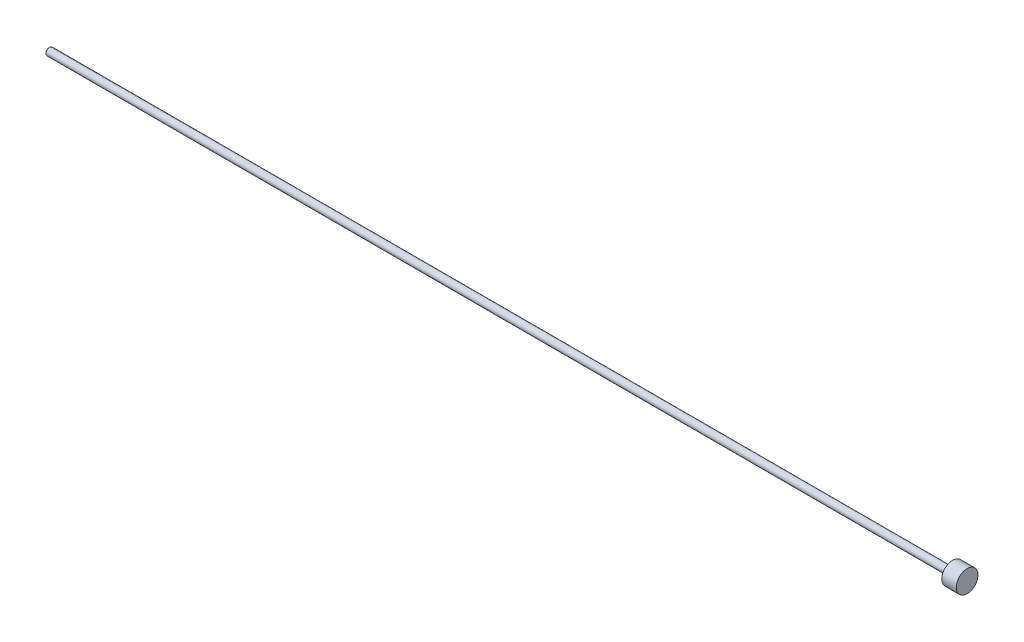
ISO-10303-21;
HEADER;
FILE_DESCRIPTION(('STEP AP214'),'2;1');
FILE_NAME('part.step','',(''),(''),'','','');
FILE_SCHEMA(('AUTOMOTIVE_DESIGN { 1 0 10303 214 1 1 1 1 }'));
ENDSEC;
DATA;
#1=APPLICATION_CONTEXT('core data for automotive mechanical design processes');
#2=APPLICATION_PROTOCOL_DEFINITION('international standard','automotive_design',2000,#1);
#3=PRODUCT_CONTEXT('',#1,'mechanical');
#4=PRODUCT('Part','Part','',(#3));
#5=PRODUCT_RELATED_PRODUCT_CATEGORY('part','',(#4));
#6=PRODUCT_DEFINITION_FORMATION('','',#4);
#7=PRODUCT_DEFINITION_CONTEXT('part definition',#1,'design');
#8=PRODUCT_DEFINITION('design','',#6,#7);
#9=PRODUCT_DEFINITION_SHAPE('','',#8);
#10=(LENGTH_UNIT() NAMED_UNIT(*) SI_UNIT(.MILLI.,.METRE.));
#11=(NAMED_UNIT(*) PLANE_ANGLE_UNIT() SI_UNIT($,.RADIAN.));
#12=(NAMED_UNIT(*) SI_UNIT($,.STERADIAN.) SOLID_ANGLE_UNIT());
#13=UNCERTAINTY_MEASURE_WITH_UNIT(LENGTH_MEASURE(1.E-05),#10,'distance_accuracy_value','');
#14=(GEOMETRIC_REPRESENTATION_CONTEXT(3) GLOBAL_UNCERTAINTY_ASSIGNED_CONTEXT((#13)) GLOBAL_UNIT_ASSIGNED_CONTEXT((#10,
#11,#12)) REPRESENTATION_CONTEXT('',''));
#15=CARTESIAN_POINT('',(0.,0.,0.));
#16=DIRECTION('',(0.,0.,1.));
#17=DIRECTION('',(1.,0.,0.));
#18=AXIS2_PLACEMENT_3D('',#15,#16,#17);
#19=CARTESIAN_POINT('',(317.893604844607,0.,0.));
#20=DIRECTION('',(1.,0.,0.));
#21=DIRECTION('',(0.,0.,-1.));
#22=AXIS2_PLACEMENT_3D('',#19,#20,#21);
#23=CYLINDRICAL_SURFACE('',#22,3.175);
#24=CARTESIAN_POINT('',(327.381860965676,0.,0.));
#25=DIRECTION('',(-1.,0.,0.));
#26=DIRECTION('',(0.,0.,1.));
#27=AXIS2_PLACEMENT_3D('',#24,#25,#26);
#28=CIRCLE('',#27,3.175);
#29=CARTESIAN_POINT('',(327.381860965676,0.,-3.175));
#30=VERTEX_POINT('',#29);
#31=EDGE_CURVE('E10',#30,#30,#28,.F.);
#32=CARTESIAN_POINT('',(1117.38536096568,0.,0.));
#33=DIRECTION('',(-1.,0.,0.));
#34=DIRECTION('',(0.,0.,1.));
#35=AXIS2_PLACEMENT_3D('',#32,#33,#34);
#36=CIRCLE('',#35,3.175);
#37=CARTESIAN_POINT('',(1117.38536096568,0.,-3.175));
#38=VERTEX_POINT('',#37);
#39=EDGE_CURVE('E42',#38,#38,#36,.T.);
#40=CARTESIAN_POINT('',(327.381860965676,0.,-3.175));
#41=CARTESIAN_POINT('',(335.611064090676,0.,-3.175));
#42=CARTESIAN_POINT('',(343.840267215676,0.,-3.175));
#43=CARTESIAN_POINT('',(360.298673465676,0.,-3.175));
#44=CARTESIAN_POINT('',(368.527876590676,0.,-3.175));
#45=CARTESIAN_POINT('',(384.986282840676,0.,-3.175));
#46=CARTESIAN_POINT('',(393.215485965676,0.,-3.175));
#47=CARTESIAN_POINT('',(409.673892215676,0.,-3.175));
#48=CARTESIAN_POINT('',(417.903095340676,0.,-3.175));
#49=CARTESIAN_POINT('',(434.361501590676,0.,-3.175));
#50=CARTESIAN_POINT('',(442.590704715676,0.,-3.175));
#51=CARTESIAN_POINT('',(459.049110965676,0.,-3.175));
#52=CARTESIAN_POINT('',(467.278314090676,0.,-3.175));
#53=CARTESIAN_POINT('',(483.736720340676,0.,-3.175));
#54=CARTESIAN_POINT('',(491.965923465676,0.,-3.175));
#55=CARTESIAN_POINT('',(508.424329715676,0.,-3.175));
#56=CARTESIAN_POINT('',(516.653532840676,0.,-3.175));
#57=CARTESIAN_POINT('',(533.111939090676,0.,-3.175));
#58=CARTESIAN_POINT('',(541.341142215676,0.,-3.175));
#59=CARTESIAN_POINT('',(557.799548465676,0.,-3.175));
#60=CARTESIAN_POINT('',(566.028751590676,0.,-3.175));
#61=CARTESIAN_POINT('',(582.487157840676,0.,-3.175));
#62=CARTESIAN_POINT('',(590.716360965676,0.,-3.175));
#63=CARTESIAN_POINT('',(607.174767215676,0.,-3.175));
#64=CARTESIAN_POINT('',(615.403970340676,0.,-3.175));
#65=CARTESIAN_POINT('',(631.862376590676,0.,-3.175));
#66=CARTESIAN_POINT('',(640.091579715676,0.,-3.175));
#67=CARTESIAN_POINT('',(656.549985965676,0.,-3.175));
#68=CARTESIAN_POINT('',(664.779189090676,0.,-3.175));
#69=CARTESIAN_POINT('',(681.237595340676,0.,-3.175));
#70=CARTESIAN_POINT('',(689.466798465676,0.,-3.175));
#71=CARTESIAN_POINT('',(705.925204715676,0.,-3.175));
#72=CARTESIAN_POINT('',(714.154407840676,0.,-3.175));
#73=CARTESIAN_POINT('',(730.612814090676,0.,-3.175));
#74=CARTESIAN_POINT('',(738.842017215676,0.,-3.175));
#75=CARTESIAN_POINT('',(755.300423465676,0.,-3.175));
#76=CARTESIAN_POINT('',(763.529626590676,0.,-3.175));
#77=CARTESIAN_POINT('',(779.988032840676,0.,-3.175));
#78=CARTESIAN_POINT('',(788.217235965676,0.,-3.175));
#79=CARTESIAN_POINT('',(804.675642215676,0.,-3.175));
#80=CARTESIAN_POINT('',(812.904845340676,0.,-3.175));
#81=CARTESIAN_POINT('',(829.363251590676,0.,-3.175));
#82=CARTESIAN_POINT('',(837.592454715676,0.,-3.175));
#83=CARTESIAN_POINT('',(854.050860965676,0.,-3.175));
#84=CARTESIAN_POINT('',(862.280064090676,0.,-3.175));
#85=CARTESIAN_POINT('',(878.738470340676,0.,-3.175));
#86=CARTESIAN_POINT('',(886.967673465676,0.,-3.175));
#87=CARTESIAN_POINT('',(903.426079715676,0.,-3.175));
#88=CARTESIAN_POINT('',(911.655282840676,0.,-3.175));
#89=CARTESIAN_POINT('',(928.113689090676,0.,-3.175));
#90=CARTESIAN_POINT('',(936.342892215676,0.,-3.175));
#91=CARTESIAN_POINT('',(952.801298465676,0.,-3.175));
#92=CARTESIAN_POINT('',(961.030501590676,0.,-3.175));
#93=CARTESIAN_POINT('',(977.488907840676,0.,-3.175));
#94=CARTESIAN_POINT('',(985.718110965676,0.,-3.175));
#95=CARTESIAN_POINT('',(1002.17651721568,0.,-3.175));
#96=CARTESIAN_POINT('',(1010.40572034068,0.,-3.175));
#97=CARTESIAN_POINT('',(1026.86412659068,0.,-3.175));
#98=CARTESIAN_POINT('',(1035.09332971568,0.,-3.175));
#99=CARTESIAN_POINT('',(1051.55173596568,0.,-3.175));
#100=CARTESIAN_POINT('',(1059.78093909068,0.,-3.175));
#101=CARTESIAN_POINT('',(1076.23934534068,0.,-3.175));
#102=CARTESIAN_POINT('',(1084.46854846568,0.,-3.175));
#103=CARTESIAN_POINT('',(1100.92695471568,0.,-3.175));
#104=CARTESIAN_POINT('',(1109.15615784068,0.,-3.175));
#105=CARTESIAN_POINT('',(1117.38536096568,0.,-3.175));
#106=B_SPLINE_CURVE_WITH_KNOTS('',3,(#40,#41,#42,#43,#44,#45,#46,#47,#48,#49,#50,#51,#52,#53,
#54,#55,#56,#57,#58,#59,#60,#61,#62,#63,#64,#65,#66,#67,#68,#69,#70,#71,#72,#73,#74,#75,#76,#77,
#78,#79,#80,#81,#82,#83,#84,#85,#86,#87,#88,#89,#90,#91,#92,#93,#94,#95,#96,#97,#98,#99,#100,
#101,#102,#103,#104,#105),.UNSPECIFIED.,.F.,.F.,(4,2,2,2,2,2,2,2,2,2,2,2,2,2,2,2,2,2,2,2,2,2,2,
2,2,2,2,2,2,2,2,2,4),(0.,24.687609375,49.37521875,74.062828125,98.7504375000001,123.438046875,
148.12565625,172.813265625,197.500875,222.188484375,246.87609375,271.563703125,296.2513125,
320.938921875,345.62653125,370.314140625,395.00175,419.689359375,444.37696875,469.064578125,
493.7521875,518.439796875,543.12740625,567.815015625,592.502625,617.190234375,641.87784375,
666.565453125,691.2530625,715.940671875,740.62828125,765.315890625,790.0035),.UNSPECIFIED.);
#107=EDGE_CURVE('BSEAM31',#30,#38,#106,.T.);
#108=ORIENTED_EDGE('',*,*,#31,.T.);
#109=ORIENTED_EDGE('',*,*,#39,.T.);
#110=ORIENTED_EDGE('',*,*,#107,.T.);
#111=ORIENTED_EDGE('',*,*,#107,.F.);
#112=EDGE_LOOP('',(#108,#110,#109,#111));
#113=FACE_BOUND('',#112,.T.);
#114=ADVANCED_FACE('F31',(#113),#23,.T.);
#115=CARTESIAN_POINT('',(326.873860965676,0.,0.));
#116=DIRECTION('',(-1.,0.,0.));
#117=DIRECTION('',(0.,0.,1.));
#118=AXIS2_PLACEMENT_3D('',#115,#116,#117);
#119=PLANE('',#118);
#120=CARTESIAN_POINT('',(326.873860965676,0.,0.));
#121=DIRECTION('',(-1.,0.,0.));
#122=DIRECTION('',(0.,0.,1.));
#123=AXIS2_PLACEMENT_3D('',#120,#121,#122);
#124=CIRCLE('',#123,2.667);
#125=CARTESIAN_POINT('',(326.873860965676,0.,2.667));
#126=VERTEX_POINT('',#125);
#127=EDGE_CURVE('E38',#126,#126,#124,.T.);
#128=ORIENTED_EDGE('',*,*,#127,.T.);
#129=EDGE_LOOP('',(#128));
#130=FACE_BOUND('',#129,.T.);
#131=ADVANCED_FACE('F73',(#130),#119,.T.);
#132=CARTESIAN_POINT('',(1117.38536096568,0.,0.));
#133=DIRECTION('',(-1.,0.,0.));
#134=DIRECTION('',(0.,0.,1.));
#135=AXIS2_PLACEMENT_3D('',#132,#133,#134);
#136=PLANE('',#135);
#137=CARTESIAN_POINT('',(1117.38536096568,0.,0.));
#138=DIRECTION('',(-1.,0.,0.));
#139=DIRECTION('',(0.,0.,1.));
#140=AXIS2_PLACEMENT_3D('',#137,#138,#139);
#141=CIRCLE('',#140,9.52500000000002);
#142=CARTESIAN_POINT('',(1117.38536096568,0.,9.52500000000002));
#143=VERTEX_POINT('',#142);
#144=EDGE_CURVE('E46',#143,#143,#141,.T.);
#145=ORIENTED_EDGE('',*,*,#144,.T.);
#146=EDGE_LOOP('',(#145));
#147=FACE_BOUND('',#146,.T.);
#148=ORIENTED_EDGE('',*,*,#39,.F.);
#149=EDGE_LOOP('',(#148));
#150=FACE_BOUND('',#149,.T.);
#151=ADVANCED_FACE('F55',(#147,#150),#136,.T.);
#152=CARTESIAN_POINT('',(1117.38536096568,0.,0.));
#153=DIRECTION('',(1.,0.,0.));
#154=DIRECTION('',(0.,0.,-1.));
#155=AXIS2_PLACEMENT_3D('',#152,#153,#154);
#156=CYLINDRICAL_SURFACE('',#155,9.52500000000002);
#157=ORIENTED_EDGE('',*,*,#144,.F.);
#158=EDGE_LOOP('',(#157));
#159=FACE_BOUND('',#158,.T.);
#160=CARTESIAN_POINT('',(1130.08536096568,0.,0.));
#161=DIRECTION('',(-1.,0.,0.));
#162=DIRECTION('',(0.,0.,1.));
#163=AXIS2_PLACEMENT_3D('',#160,#161,#162);
#164=CIRCLE('',#163,9.52500000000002);
#165=CARTESIAN_POINT('',(1130.08536096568,0.,9.52500000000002));
#166=VERTEX_POINT('',#165);
#167=EDGE_CURVE('E49',#166,#166,#164,.T.);
#168=ORIENTED_EDGE('',*,*,#167,.T.);
#169=EDGE_LOOP('',(#168));
#170=FACE_BOUND('',#169,.T.);
#171=ADVANCED_FACE('F58',(#159,#170),#156,.T.);
#172=CARTESIAN_POINT('',(1130.08536096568,0.,0.));
#173=DIRECTION('',(-1.,0.,0.));
#174=DIRECTION('',(0.,0.,1.));
#175=AXIS2_PLACEMENT_3D('',#172,#173,#174);
#176=PLANE('',#175);
#177=ORIENTED_EDGE('',*,*,#167,.F.);
#178=EDGE_LOOP('',(#177));
#179=FACE_BOUND('',#178,.T.);
#180=ADVANCED_FACE('F61',(#179),#176,.F.);
#181=CARTESIAN_POINT('',(326.873860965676,0.,0.));
#182=DIRECTION('',(1.,0.,0.));
#183=DIRECTION('',(0.,0.,-1.));
#184=AXIS2_PLACEMENT_3D('',#181,#182,#183);
#185=CONICAL_SURFACE('',#184,2.667,0.785398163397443);
#186=ORIENTED_EDGE('',*,*,#31,.F.);
#187=EDGE_LOOP('',(#186));
#188=FACE_BOUND('',#187,.T.);
#189=ORIENTED_EDGE('',*,*,#127,.F.);
#190=EDGE_LOOP('',(#189));
#191=FACE_BOUND('',#190,.T.);
#192=ADVANCED_FACE('F33',(#188,#191),#185,.T.);
#193=CLOSED_SHELL('',(#114,#131,#151,#171,#180,#192));
#194=MANIFOLD_SOLID_BREP('B2',#193);
#195=ADVANCED_BREP_SHAPE_REPRESENTATION('',(#18,#194),#14);
#196=SHAPE_DEFINITION_REPRESENTATION(#9,#195);
ENDSEC;
END-ISO-10303-21;
